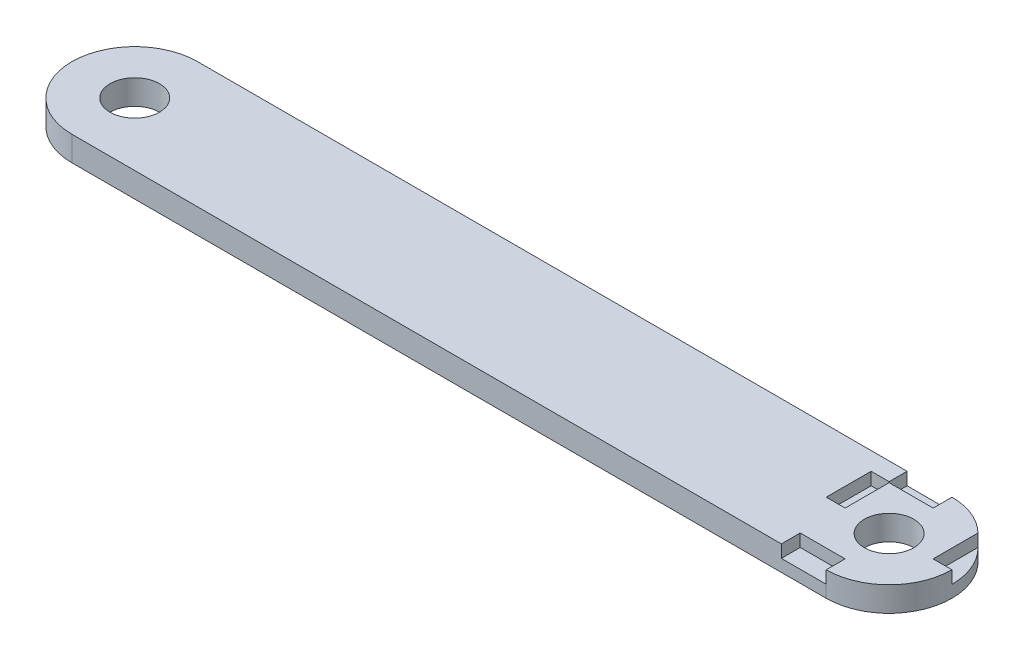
from build123d import *

# Parameters (mm, degrees)
BOSS_EXTRUDE1_DEPTH = 5
SKETCH2_R           = 5
CUT_EXTRUDE1_DEPTH  = 5
SKETCH3_W           = 9.069614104
SKETCH3_H           = 3.81
CUT_EXTRUDE2_DEPTH  = 2.54
CIRPATTERN1_COUNT   = 2
CIRPATTERN1_ANGLE   = 270


with BuildPart() as part:
    # Sketch1 → Boss-Extrude1 (new body)
    with BuildSketch(Plane(origin=(0, 0, 0), x_dir=(1, 0, 0), z_dir=(0, 1, 0))):
        with BuildLine():
            Line((-73.554166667, 11.377083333), (78.845833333, 11.377083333))
            ThreePointArc((78.845833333, 11.377083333), (91.545833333, -1.322916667), (78.845833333, -14.022916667))
            Line((78.845833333, -14.022916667), (-73.554166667, -14.022916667))
            ThreePointArc((-73.554166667, -14.022916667), (-86.254166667, -1.322916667), (-73.554166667, 11.377083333))
        make_face()
    extrude(amount=BOSS_EXTRUDE1_DEPTH)

    # Sketch2 → Cut-Extrude1 (cut)
    with BuildSketch(Plane(origin=(0, 0, 0), x_dir=(1, 0, 0), z_dir=(0, 1, 0))):
        with Locations(Location((-73.554166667, -1.322916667, 0), (0, 0, 270))):
            Circle(SKETCH2_R)
        with Locations(Location((78.845833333, -1.322916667, 0), (0, 0, 270))):
            Circle(SKETCH2_R)
    extrude(amount=CUT_EXTRUDE1_DEPTH, mode=Mode.SUBTRACT)

    # Sketch3 → Cut-Extrude2 (cut)
    with BuildSketch(Plane(origin=(0, 5, 0), x_dir=(1, 0, 0), z_dir=(0, 1, 0))):
        with Locations((74.311026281, 9.472083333)):
            Rectangle(SKETCH3_W, SKETCH3_H)
        with Locations((74.311026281, -12.117916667)):
            Rectangle(SKETCH3_W, SKETCH3_H)
    cut_extrude2 = extrude(amount=-CUT_EXTRUDE2_DEPTH, mode=Mode.SUBTRACT)

    # CirPattern1: Cut-Extrude2 ×2 about axis
    cirpattern1_axis = Axis((78.845833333, 0, 1.322916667), (0, 1, 0))
    for i in range(1, CIRPATTERN1_COUNT):
        add(cut_extrude2.rotate(cirpattern1_axis, i * CIRPATTERN1_ANGLE / (CIRPATTERN1_COUNT - 1)), mode=Mode.SUBTRACT)


solid = part.part
